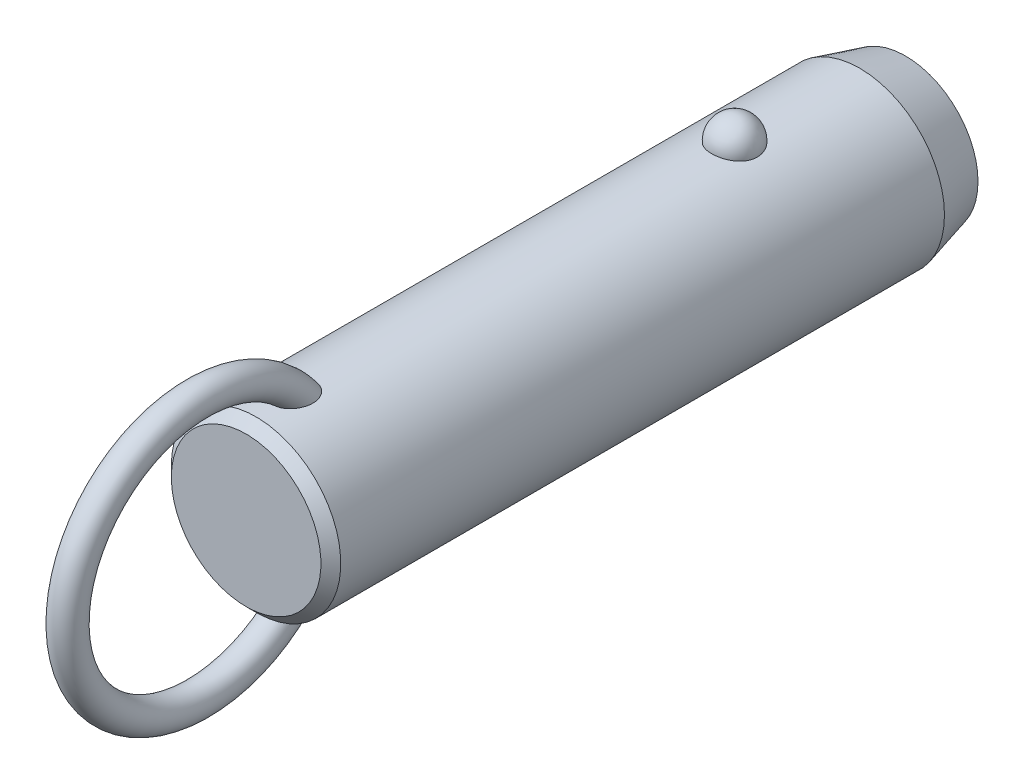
ISO-10303-21;
HEADER;
FILE_DESCRIPTION(('STEP AP214'),'2;1');
FILE_NAME('part.step','',(''),(''),'','','');
FILE_SCHEMA(('AUTOMOTIVE_DESIGN { 1 0 10303 214 1 1 1 1 }'));
ENDSEC;
DATA;
#1=APPLICATION_CONTEXT('core data for automotive mechanical design processes');
#2=APPLICATION_PROTOCOL_DEFINITION('international standard','automotive_design',2000,#1);
#3=PRODUCT_CONTEXT('',#1,'mechanical');
#4=PRODUCT('Part','Part','',(#3));
#5=PRODUCT_RELATED_PRODUCT_CATEGORY('part','',(#4));
#6=PRODUCT_DEFINITION_FORMATION('','',#4);
#7=PRODUCT_DEFINITION_CONTEXT('part definition',#1,'design');
#8=PRODUCT_DEFINITION('design','',#6,#7);
#9=PRODUCT_DEFINITION_SHAPE('','',#8);
#10=(LENGTH_UNIT() NAMED_UNIT(*) SI_UNIT(.MILLI.,.METRE.));
#11=(NAMED_UNIT(*) PLANE_ANGLE_UNIT() SI_UNIT($,.RADIAN.));
#12=(NAMED_UNIT(*) SI_UNIT($,.STERADIAN.) SOLID_ANGLE_UNIT());
#13=UNCERTAINTY_MEASURE_WITH_UNIT(LENGTH_MEASURE(1.E-05),#10,'distance_accuracy_value','');
#14=(GEOMETRIC_REPRESENTATION_CONTEXT(3) GLOBAL_UNCERTAINTY_ASSIGNED_CONTEXT((#13)) GLOBAL_UNIT_ASSIGNED_CONTEXT((#10,
#11,#12)) REPRESENTATION_CONTEXT('',''));
#15=CARTESIAN_POINT('',(0.,0.,0.));
#16=DIRECTION('',(0.,0.,1.));
#17=DIRECTION('',(1.,0.,0.));
#18=AXIS2_PLACEMENT_3D('',#15,#16,#17);
#19=CARTESIAN_POINT('',(0.,0.,48.3));
#20=DIRECTION('',(0.,0.,-1.));
#21=DIRECTION('',(-1.,0.,0.));
#22=AXIS2_PLACEMENT_3D('',#19,#20,#21);
#23=CYLINDRICAL_SURFACE('',#22,11.1);
#24=CARTESIAN_POINT('',(2.9724815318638,10.6945945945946,-3.));
#25=CARTESIAN_POINT('',(2.97247830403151,10.6945972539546,-2.83225059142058));
#26=CARTESIAN_POINT('',(2.95876598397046,10.6984356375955,-2.6644597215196));
#27=CARTESIAN_POINT('',(2.90424529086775,10.7133624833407,-2.33362381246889));
#28=CARTESIAN_POINT('',(2.8634252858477,10.7244540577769,-2.1705808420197));
#29=CARTESIAN_POINT('',(2.75573657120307,10.7526272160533,-1.85396767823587));
#30=CARTESIAN_POINT('',(2.68887937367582,10.7697061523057,-1.70039333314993));
#31=CARTESIAN_POINT('',(2.53079696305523,10.8079438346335,-1.40691598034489));
#32=CARTESIAN_POINT('',(2.43957264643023,10.8291024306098,-1.2670124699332));
#33=CARTESIAN_POINT('',(2.23458150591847,10.8732541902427,-1.00409565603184));
#34=CARTESIAN_POINT('',(2.12071295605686,10.8962553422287,-0.881162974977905));
#35=CARTESIAN_POINT('',(1.87365402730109,10.9414421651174,-0.656352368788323));
#36=CARTESIAN_POINT('',(1.74046358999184,10.9636278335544,-0.554474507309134));
#37=CARTESIAN_POINT('',(1.45872188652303,11.0046495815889,-0.374872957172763));
#38=CARTESIAN_POINT('',(1.31021276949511,11.0234944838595,-0.297085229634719));
#39=CARTESIAN_POINT('',(1.00170030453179,11.0557957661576,-0.16752977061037));
#40=CARTESIAN_POINT('',(0.841698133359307,11.0692526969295,-0.115759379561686));
#41=CARTESIAN_POINT('',(0.517607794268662,11.0890932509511,-0.040392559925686));
#42=CARTESIAN_POINT('',(0.353633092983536,11.0955916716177,-0.0163383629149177));
#43=CARTESIAN_POINT('',(0.0238420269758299,11.1011989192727,0.00445177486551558));
#44=CARTESIAN_POINT('',(-0.141974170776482,11.1003084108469,0.00119017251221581));
#45=CARTESIAN_POINT('',(-0.468405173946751,11.0912990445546,-0.0323233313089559));
#46=CARTESIAN_POINT('',(-0.629059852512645,11.0832767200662,-0.0622147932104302));
#47=CARTESIAN_POINT('',(-0.942937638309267,11.0609962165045,-0.147645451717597));
#48=CARTESIAN_POINT('',(-1.09616062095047,11.0467379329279,-0.203185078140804));
#49=CARTESIAN_POINT('',(-1.39181061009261,11.0134071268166,-0.3387529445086));
#50=CARTESIAN_POINT('',(-1.53417383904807,10.9943086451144,-0.418913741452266));
#51=CARTESIAN_POINT('',(-1.80342160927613,10.9533667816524,-0.601448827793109));
#52=CARTESIAN_POINT('',(-1.9303046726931,10.9315231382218,-0.703825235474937));
#53=CARTESIAN_POINT('',(-2.16747598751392,10.887005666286,-0.930091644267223));
#54=CARTESIAN_POINT('',(-2.27742774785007,10.8643239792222,-1.05433291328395));
#55=CARTESIAN_POINT('',(-2.47517316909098,10.8209886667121,-1.31966633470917));
#56=CARTESIAN_POINT('',(-2.56296538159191,10.8003351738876,-1.46075958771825));
#57=CARTESIAN_POINT('',(-2.71500300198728,10.7631304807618,-1.75753646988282));
#58=CARTESIAN_POINT('',(-2.77898901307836,10.7466250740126,-1.9133588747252));
#59=CARTESIAN_POINT('',(-2.88046189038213,10.7198747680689,-2.2339152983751));
#60=CARTESIAN_POINT('',(-2.91794947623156,10.709629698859,-2.39864907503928));
#61=CARTESIAN_POINT('',(-2.96537819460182,10.6965949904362,-2.73165170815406));
#62=CARTESIAN_POINT('',(-2.97542891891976,10.693775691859,-2.89990378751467));
#63=CARTESIAN_POINT('',(-2.96804271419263,10.6958279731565,-3.235752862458));
#64=CARTESIAN_POINT('',(-2.95060646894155,10.7006993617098,-3.40334987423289));
#65=CARTESIAN_POINT('',(-2.88883358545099,10.71753912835,-3.73233906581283));
#66=CARTESIAN_POINT('',(-2.84462026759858,10.7294749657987,-3.89375610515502));
#67=CARTESIAN_POINT('',(-2.73050447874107,10.7590797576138,-4.20667949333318));
#68=CARTESIAN_POINT('',(-2.66060103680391,10.7767489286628,-4.35818546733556));
#69=CARTESIAN_POINT('',(-2.49642559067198,10.8159599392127,-4.6478542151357));
#70=CARTESIAN_POINT('',(-2.40203047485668,10.8375211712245,-4.78594458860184));
#71=CARTESIAN_POINT('',(-2.19143488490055,10.8820570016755,-5.0441038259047));
#72=CARTESIAN_POINT('',(-2.07523364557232,10.9050316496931,-5.16417205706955));
#73=CARTESIAN_POINT('',(-1.82361254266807,10.9499219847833,-5.38334833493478));
#74=CARTESIAN_POINT('',(-1.68812945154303,10.9718338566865,-5.48238464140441));
#75=CARTESIAN_POINT('',(-1.40191298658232,11.0120611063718,-5.65618873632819));
#76=CARTESIAN_POINT('',(-1.25118062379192,11.0303767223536,-5.73095813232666));
#77=CARTESIAN_POINT('',(-0.940570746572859,11.0611653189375,-5.85334725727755));
#78=CARTESIAN_POINT('',(-0.780821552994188,11.0737044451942,-5.90127578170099));
#79=CARTESIAN_POINT('',(-0.455204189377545,11.0918598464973,-5.96992976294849));
#80=CARTESIAN_POINT('',(-0.289336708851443,11.0974768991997,-5.99065827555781));
#81=CARTESIAN_POINT('',(0.0406846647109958,11.1011307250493,-6.00418773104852));
#82=CARTESIAN_POINT('',(0.204817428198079,11.099299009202,-5.99747318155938));
#83=CARTESIAN_POINT('',(0.529553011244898,11.088551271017,-5.9574031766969));
#84=CARTESIAN_POINT('',(0.690155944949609,11.0796354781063,-5.92404858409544));
#85=CARTESIAN_POINT('',(1.0027760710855,11.0557204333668,-5.83180084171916));
#86=CARTESIAN_POINT('',(1.15482001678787,11.0407414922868,-5.77299291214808));
#87=CARTESIAN_POINT('',(1.44678373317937,11.0062913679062,-5.63147366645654));
#88=CARTESIAN_POINT('',(1.58670279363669,10.9868199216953,-5.54876095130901));
#89=CARTESIAN_POINT('',(1.8527023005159,10.9451315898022,-5.36027644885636));
#90=CARTESIAN_POINT('',(1.97855158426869,10.9228788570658,-5.25418644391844));
#91=CARTESIAN_POINT('',(2.21080872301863,10.8782509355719,-5.02251354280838));
#92=CARTESIAN_POINT('',(2.31721312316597,10.8558757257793,-4.89692718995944));
#93=CARTESIAN_POINT('',(2.5094551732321,10.8130715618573,-4.62745408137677));
#94=CARTESIAN_POINT('',(2.59493284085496,10.7926798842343,-4.48330448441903));
#95=CARTESIAN_POINT('',(2.740862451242,10.7565495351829,-4.18236358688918));
#96=CARTESIAN_POINT('',(2.80132490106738,10.7408089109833,-4.02557762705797));
#97=CARTESIAN_POINT('',(2.88959070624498,10.7173718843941,-3.72475308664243));
#98=CARTESIAN_POINT('',(2.92062102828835,10.7088950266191,-3.58171216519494));
#99=CARTESIAN_POINT('',(2.96206765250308,10.6975052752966,-3.29245795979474));
#100=CARTESIAN_POINT('',(2.97248434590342,10.6945922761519,-3.14624473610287));
#101=CARTESIAN_POINT('',(2.9724815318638,10.6945945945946,-3.));
#102=B_SPLINE_CURVE_WITH_KNOTS('',3,(#24,#25,#26,#27,#28,#29,#30,#31,#32,#33,#34,#35,#36,#37,
#38,#39,#40,#41,#42,#43,#44,#45,#46,#47,#48,#49,#50,#51,#52,#53,#54,#55,#56,#57,#58,#59,#60,#61,
#62,#63,#64,#65,#66,#67,#68,#69,#70,#71,#72,#73,#74,#75,#76,#77,#78,#79,#80,#81,#82,#83,#84,#85,
#86,#87,#88,#89,#90,#91,#92,#93,#94,#95,#96,#97,#98,#99,#100,#101),.UNSPECIFIED.,.T.,.F.,(4,2,2,
2,2,2,2,2,2,2,2,2,2,2,2,2,2,2,2,2,2,2,2,2,2,2,2,2,2,2,2,2,2,2,2,2,2,2,4),(0.,0.502722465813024,
1.00566079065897,1.5083769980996,2.01107471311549,2.51608392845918,3.02109467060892,
3.52475118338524,4.02835620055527,4.523518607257,5.0186364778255,5.50715297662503,
5.9956776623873,6.48688002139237,6.97812923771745,7.47814366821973,7.9781907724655,
8.48353712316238,8.9888697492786,9.49218093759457,9.99547960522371,10.4964777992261,
10.997494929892,11.5010810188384,12.0046847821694,12.5099796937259,13.0152411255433,
13.5145635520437,14.0138298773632,14.5043200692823,14.9947943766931,15.4836390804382,
15.9725123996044,16.4685040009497,16.9645836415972,17.4686765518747,17.972557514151,
18.410841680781,18.849117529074),.UNSPECIFIED.);
#103=CARTESIAN_POINT('',(2.9724815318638,10.6945945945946,-3.));
#104=VERTEX_POINT('',#103);
#105=EDGE_CURVE('E41',#104,#104,#102,.T.);
#106=ORIENTED_EDGE('',*,*,#105,.T.);
#107=EDGE_LOOP('',(#106));
#108=FACE_BOUND('',#107,.T.);
#109=CARTESIAN_POINT('',(0.,0.,59.7000000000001));
#110=DIRECTION('',(0.,0.,1.));
#111=DIRECTION('',(1.,0.,0.));
#112=AXIS2_PLACEMENT_3D('',#109,#110,#111);
#113=CIRCLE('',#112,11.1);
#114=CARTESIAN_POINT('',(-11.1,0.,59.7000000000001));
#115=VERTEX_POINT('',#114);
#116=EDGE_CURVE('E10',#115,#115,#113,.F.);
#117=ORIENTED_EDGE('',*,*,#116,.T.);
#118=EDGE_LOOP('',(#117));
#119=FACE_BOUND('',#118,.T.);
#120=CARTESIAN_POINT('',(-0.56452033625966,-11.0856356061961,51.957815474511));
#121=CARTESIAN_POINT('',(-0.66720283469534,-11.0804062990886,51.9912839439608));
#122=CARTESIAN_POINT('',(-0.766875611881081,-11.0738877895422,52.0338357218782));
#123=CARTESIAN_POINT('',(-0.957284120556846,-11.0590576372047,52.1354190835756));
#124=CARTESIAN_POINT('',(-1.04801616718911,-11.0507452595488,52.1944574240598));
#125=CARTESIAN_POINT('',(-1.21800952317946,-11.0333016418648,52.3265293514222));
#126=CARTESIAN_POINT('',(-1.29730805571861,-11.0241732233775,52.3995156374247));
#127=CARTESIAN_POINT('',(-1.44337665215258,-11.0060026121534,52.5570374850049));
#128=CARTESIAN_POINT('',(-1.51014622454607,-10.9969604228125,52.6415734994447));
#129=CARTESIAN_POINT('',(-1.63454620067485,-10.9791841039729,52.8255213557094));
#130=CARTESIAN_POINT('',(-1.69127003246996,-10.9705107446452,52.9255493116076));
#131=CARTESIAN_POINT('',(-1.78980785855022,-10.9548648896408,53.1327902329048));
#132=CARTESIAN_POINT('',(-1.83161214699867,-10.9478935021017,53.2400078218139));
#133=CARTESIAN_POINT('',(-1.91557028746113,-10.9335803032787,53.5054080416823));
#134=CARTESIAN_POINT('',(-1.95040620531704,-10.9273269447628,53.6659806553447));
#135=CARTESIAN_POINT('',(-1.99388326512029,-10.9194709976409,53.9906977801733));
#136=CARTESIAN_POINT('',(-2.00248051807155,-10.9178762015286,54.1548478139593));
#137=CARTESIAN_POINT('',(-1.99551615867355,-10.9191578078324,54.5246504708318));
#138=CARTESIAN_POINT('',(-1.9732206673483,-10.9232807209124,54.7301911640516));
#139=CARTESIAN_POINT('',(-1.9152976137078,-10.9335244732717,55.033595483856));
#140=CARTESIAN_POINT('',(-1.89184575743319,-10.9376266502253,55.1340883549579));
#141=CARTESIAN_POINT('',(-1.83700674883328,-10.9469720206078,55.332855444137));
#142=CARTESIAN_POINT('',(-1.80562070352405,-10.9522150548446,55.4311299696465));
#143=CARTESIAN_POINT('',(-1.73463055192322,-10.9636837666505,55.6259148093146));
#144=CARTESIAN_POINT('',(-1.69493416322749,-10.9699202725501,55.7223907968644));
#145=CARTESIAN_POINT('',(-1.60745141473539,-10.9830806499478,55.9116262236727));
#146=CARTESIAN_POINT('',(-1.55966150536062,-10.9900048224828,56.0043840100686));
#147=CARTESIAN_POINT('',(-1.45591812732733,-11.0042280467,56.1846907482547));
#148=CARTESIAN_POINT('',(-1.40000013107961,-11.0115253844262,56.2722601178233));
#149=CARTESIAN_POINT('',(-1.2793747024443,-11.0261911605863,56.441029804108));
#150=CARTESIAN_POINT('',(-1.21467835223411,-11.0335594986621,56.5222379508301));
#151=CARTESIAN_POINT('',(-1.08218150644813,-11.0473027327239,56.6690010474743));
#152=CARTESIAN_POINT('',(-1.0152263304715,-11.0537063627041,56.7353092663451));
#153=CARTESIAN_POINT('',(-0.872952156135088,-11.065850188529,56.8583780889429));
#154=CARTESIAN_POINT('',(-0.797642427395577,-11.0715911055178,56.9151491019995));
#155=CARTESIAN_POINT('',(-0.651396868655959,-11.081071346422,57.0075155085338));
#156=CARTESIAN_POINT('',(-0.581712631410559,-11.0849841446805,57.0450491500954));
#157=CARTESIAN_POINT('',(-0.437066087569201,-11.0916271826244,57.1082594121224));
#158=CARTESIAN_POINT('',(-0.362109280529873,-11.0943586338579,57.1339481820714));
#159=CARTESIAN_POINT('',(-0.207828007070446,-11.0983242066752,57.171117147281));
#160=CARTESIAN_POINT('',(-0.128467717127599,-11.0995432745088,57.1824545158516));
#161=CARTESIAN_POINT('',(0.0309101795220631,-11.1002423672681,57.1889658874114));
#162=CARTESIAN_POINT('',(0.110927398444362,-11.0997233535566,57.1841488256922));
#163=CARTESIAN_POINT('',(0.256406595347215,-11.097240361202,57.1609599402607));
#164=CARTESIAN_POINT('',(0.322235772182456,-11.0955074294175,57.1447543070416));
#165=CARTESIAN_POINT('',(0.450635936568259,-11.0910350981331,57.1026008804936));
#166=CARTESIAN_POINT('',(0.513205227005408,-11.0882951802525,57.0766480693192));
#167=CARTESIAN_POINT('',(0.662626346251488,-11.0805620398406,57.0026073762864));
#168=CARTESIAN_POINT('',(0.747127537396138,-11.0751144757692,56.9498452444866));
#169=CARTESIAN_POINT('',(0.906756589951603,-11.0631932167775,56.8317206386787));
#170=CARTESIAN_POINT('',(0.981859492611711,-11.0567168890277,56.7663257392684));
#171=CARTESIAN_POINT('',(1.1071220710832,-11.0447856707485,56.6422633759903));
#172=CARTESIAN_POINT('',(1.15909566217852,-11.0394280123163,56.5853831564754));
#173=CARTESIAN_POINT('',(1.25791923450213,-11.0286040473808,56.4673271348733));
#174=CARTESIAN_POINT('',(1.30476642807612,-11.0231376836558,56.4061490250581));
#175=CARTESIAN_POINT('',(1.43818612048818,-11.0068027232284,56.217305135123));
#176=CARTESIAN_POINT('',(1.51751767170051,-10.9960104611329,56.0844531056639));
#177=CARTESIAN_POINT('',(1.63597546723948,-10.9788847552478,55.8531371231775));
#178=CARTESIAN_POINT('',(1.67988876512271,-10.9722190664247,55.7570530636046));
#179=CARTESIAN_POINT('',(1.75953241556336,-10.9597298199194,55.5614311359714));
#180=CARTESIAN_POINT('',(1.79525967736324,-10.9539065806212,55.4618919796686));
#181=CARTESIAN_POINT('',(1.85844731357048,-10.9433632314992,55.2602111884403));
#182=CARTESIAN_POINT('',(1.88591073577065,-10.9386427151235,55.1580705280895));
#183=CARTESIAN_POINT('',(1.93234324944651,-10.9305350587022,54.951819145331));
#184=CARTESIAN_POINT('',(1.95131065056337,-10.9271481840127,54.8477080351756));
#185=CARTESIAN_POINT('',(1.99040203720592,-10.9201183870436,54.5654588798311));
#186=CARTESIAN_POINT('',(2.00221217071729,-10.9179256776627,54.3860370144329));
#187=CARTESIAN_POINT('',(1.99711676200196,-10.9188636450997,54.0277133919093));
#188=CARTESIAN_POINT('',(1.98026150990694,-10.9219849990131,53.8488112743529));
#189=CARTESIAN_POINT('',(1.92151657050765,-10.9324473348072,53.5364514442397));
#190=CARTESIAN_POINT('',(1.88605081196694,-10.9386915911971,53.4017594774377));
#191=CARTESIAN_POINT('',(1.79393020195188,-10.9541780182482,53.1399669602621));
#192=CARTESIAN_POINT('',(1.73729868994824,-10.9634168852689,53.0128582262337));
#193=CARTESIAN_POINT('',(1.61237037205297,-10.9824218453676,52.7894184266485));
#194=CARTESIAN_POINT('',(1.54715374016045,-10.9918945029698,52.6913455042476));
#195=CARTESIAN_POINT('',(1.40127026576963,-11.0114415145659,52.5074341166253));
#196=CARTESIAN_POINT('',(1.3206074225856,-11.0215157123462,52.4215924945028));
#197=CARTESIAN_POINT('',(1.1447478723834,-11.041168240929,52.2651630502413));
#198=CARTESIAN_POINT('',(1.0494780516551,-11.0507437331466,52.1946565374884));
#199=CARTESIAN_POINT('',(0.847278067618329,-11.0680789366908,52.072640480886));
#200=CARTESIAN_POINT('',(0.740351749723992,-11.0758392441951,52.0211246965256));
#201=CARTESIAN_POINT('',(0.52928931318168,-11.0878275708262,51.9434852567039));
#202=CARTESIAN_POINT('',(0.425895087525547,-11.0923259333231,51.915377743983));
#203=CARTESIAN_POINT('',(0.215723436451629,-11.0984001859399,51.8777038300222));
#204=CARTESIAN_POINT('',(0.108947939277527,-11.0999777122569,51.8681270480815));
#205=CARTESIAN_POINT('',(-0.0938962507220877,-11.1000196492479,51.8678773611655));
#206=CARTESIAN_POINT('',(-0.189967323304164,-11.0987797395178,51.8754089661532));
#207=CARTESIAN_POINT('',(-0.3796579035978,-11.0939111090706,51.9055079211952));
#208=CARTESIAN_POINT('',(-0.473277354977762,-11.0902823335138,51.9280756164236));
#209=CARTESIAN_POINT('',(-0.56452033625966,-11.0856356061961,51.957815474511));
#210=B_SPLINE_CURVE_WITH_KNOTS('',3,(#120,#121,#122,#123,#124,#125,#126,#127,#128,#129,#130,
#131,#132,#133,#134,#135,#136,#137,#138,#139,#140,#141,#142,#143,#144,#145,#146,#147,#148,#149,
#150,#151,#152,#153,#154,#155,#156,#157,#158,#159,#160,#161,#162,#163,#164,#165,#166,#167,#168,
#169,#170,#171,#172,#173,#174,#175,#176,#177,#178,#179,#180,#181,#182,#183,#184,#185,#186,#187,
#188,#189,#190,#191,#192,#193,#194,#195,#196,#197,#198,#199,#200,#201,#202,#203,#204,#205,#206,
#207,#208,#209),.UNSPECIFIED.,.T.,.F.,(4,2,2,2,2,2,2,2,2,2,2,2,2,2,2,2,2,2,2,2,2,2,2,2,2,2,2,2,
2,2,2,2,2,2,2,2,2,2,2,2,2,2,2,2,4),(0.,0.323999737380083,0.648132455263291,0.971184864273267,
1.29424994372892,1.6388623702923,1.98369857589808,2.4742605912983,2.96564271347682,
3.58257396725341,3.89215258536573,4.20168803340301,4.51486273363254,4.82817514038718,
5.14015911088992,5.45175282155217,5.734428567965,6.01679375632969,6.25364580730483,
6.49025437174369,6.72919963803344,6.9680127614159,7.17061258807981,7.37331685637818,
7.67094989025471,7.96935728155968,8.20075067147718,8.4322692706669,8.8958162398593,
9.21306533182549,9.53043400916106,9.84768549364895,10.1650000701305,10.70229304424,
11.2386443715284,11.6553390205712,12.0715755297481,12.4245637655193,12.7774607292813,
13.1321855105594,13.4867936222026,13.8068771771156,14.1267813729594,14.4146787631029,
14.7025827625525),.UNSPECIFIED.);
#211=CARTESIAN_POINT('',(-0.56452033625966,-11.0856356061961,51.957815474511));
#212=VERTEX_POINT('',#211);
#213=EDGE_CURVE('E59',#212,#212,#210,.T.);
#214=ORIENTED_EDGE('',*,*,#213,.T.);
#215=EDGE_LOOP('',(#214));
#216=FACE_BOUND('',#215,.T.);
#217=CARTESIAN_POINT('',(-0.56452033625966,11.0856356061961,51.957815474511));
#218=CARTESIAN_POINT('',(-0.468542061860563,11.0905203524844,51.9265456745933));
#219=CARTESIAN_POINT('',(-0.369793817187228,11.0942886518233,51.9031576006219));
#220=CARTESIAN_POINT('',(-0.16955579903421,11.0991586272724,51.8730858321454));
#221=CARTESIAN_POINT('',(-0.0680604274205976,11.1002543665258,51.8664393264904));
#222=CARTESIAN_POINT('',(0.134549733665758,11.099646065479,51.8701579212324));
#223=CARTESIAN_POINT('',(0.235664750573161,11.0979441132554,51.8805103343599));
#224=CARTESIAN_POINT('',(0.434632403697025,11.0919342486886,51.9178318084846));
#225=CARTESIAN_POINT('',(0.532486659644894,11.0876276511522,51.9447924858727));
#226=CARTESIAN_POINT('',(0.722445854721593,11.0768742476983,52.0144096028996));
#227=CARTESIAN_POINT('',(0.814543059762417,11.0704246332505,52.0570866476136));
#228=CARTESIAN_POINT('',(0.990565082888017,11.0560659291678,52.1566487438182));
#229=CARTESIAN_POINT('',(1.07448844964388,11.048156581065,52.2135363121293));
#230=CARTESIAN_POINT('',(1.23562672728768,11.0313221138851,52.3422106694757));
#231=CARTESIAN_POINT('',(1.31242684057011,11.0223686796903,52.4145117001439));
#232=CARTESIAN_POINT('',(1.45398030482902,11.0045918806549,52.5700425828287));
#233=CARTESIAN_POINT('',(1.51873073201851,10.9957685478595,52.6532750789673));
#234=CARTESIAN_POINT('',(1.64107232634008,10.9782087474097,52.8363842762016));
#235=CARTESIAN_POINT('',(1.6974317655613,10.9695572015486,52.9370893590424));
#236=CARTESIAN_POINT('',(1.79515063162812,10.9539887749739,53.1456264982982));
#237=CARTESIAN_POINT('',(1.83649966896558,10.9470730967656,53.2534634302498));
#238=CARTESIAN_POINT('',(1.91931148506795,10.9329211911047,53.5203995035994));
#239=CARTESIAN_POINT('',(1.95340104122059,10.9267904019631,53.6818612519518));
#240=CARTESIAN_POINT('',(1.99526195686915,10.9192174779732,54.0082163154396));
#241=CARTESIAN_POINT('',(2.00298989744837,10.9177830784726,54.1731148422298));
#242=CARTESIAN_POINT('',(1.99396251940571,10.9194420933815,54.5441006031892));
#243=CARTESIAN_POINT('',(1.97050829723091,10.923774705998,54.7500387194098));
#244=CARTESIAN_POINT('',(1.91079643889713,10.9343131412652,55.0539019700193));
#245=CARTESIAN_POINT('',(1.8867370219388,10.9385106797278,55.1545296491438));
#246=CARTESIAN_POINT('',(1.83065508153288,10.9480376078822,55.3535107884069));
#247=CARTESIAN_POINT('',(1.79863369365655,10.9533668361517,55.451864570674));
#248=CARTESIAN_POINT('',(1.72633365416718,10.9649954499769,55.6467203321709));
#249=CARTESIAN_POINT('',(1.68596409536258,10.9713053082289,55.7431879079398));
#250=CARTESIAN_POINT('',(1.59707998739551,10.9845964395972,55.9323233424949));
#251=CARTESIAN_POINT('',(1.54856169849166,10.9915780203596,56.0249894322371));
#252=CARTESIAN_POINT('',(1.4433016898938,11.0058935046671,56.2049752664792));
#253=CARTESIAN_POINT('',(1.38659749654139,11.0132257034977,56.292316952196));
#254=CARTESIAN_POINT('',(1.26431158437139,11.0279330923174,56.4604563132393));
#255=CARTESIAN_POINT('',(1.198741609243,11.0353082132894,56.5412624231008));
#256=CARTESIAN_POINT('',(1.06542088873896,11.048931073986,56.6859856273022));
#257=CARTESIAN_POINT('',(0.998640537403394,11.0552153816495,56.750784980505));
#258=CARTESIAN_POINT('',(0.856896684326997,11.0671032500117,56.8708462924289));
#259=CARTESIAN_POINT('',(0.781942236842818,11.0727075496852,56.9261186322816));
#260=CARTESIAN_POINT('',(0.636276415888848,11.081949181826,57.0159721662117));
#261=CARTESIAN_POINT('',(0.566755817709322,11.0857572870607,57.0524410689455));
#262=CARTESIAN_POINT('',(0.422602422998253,11.0921860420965,57.1135333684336));
#263=CARTESIAN_POINT('',(0.347974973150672,11.0948079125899,57.1381689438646));
#264=CARTESIAN_POINT('',(0.194593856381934,11.0985608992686,57.1733233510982));
#265=CARTESIAN_POINT('',(0.11580793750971,11.0996777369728,57.1837069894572));
#266=CARTESIAN_POINT('',(-0.042249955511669,11.1002003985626,57.1885747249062));
#267=CARTESIAN_POINT('',(-0.121521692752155,11.09960699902,57.183066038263));
#268=CARTESIAN_POINT('',(-0.266046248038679,11.0970123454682,57.1588271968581));
#269=CARTESIAN_POINT('',(-0.331661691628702,11.0952283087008,57.1421356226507));
#270=CARTESIAN_POINT('',(-0.459588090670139,11.0906663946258,57.0991117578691));
#271=CARTESIAN_POINT('',(-0.521897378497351,11.0878880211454,57.072774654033));
#272=CARTESIAN_POINT('',(-0.671446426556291,11.0800342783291,56.9975130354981));
#273=CARTESIAN_POINT('',(-0.756250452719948,11.0744969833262,56.9438182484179));
#274=CARTESIAN_POINT('',(-0.916349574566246,11.0624045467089,56.8238029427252));
#275=CARTESIAN_POINT('',(-0.991618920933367,11.0558467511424,56.7574493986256));
#276=CARTESIAN_POINT('',(-1.11713140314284,11.0437783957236,56.6316335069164));
#277=CARTESIAN_POINT('',(-1.16920539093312,11.0383619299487,56.5739524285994));
#278=CARTESIAN_POINT('',(-1.26817476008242,11.02743010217,56.4542809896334));
#279=CARTESIAN_POINT('',(-1.315067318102,11.0219146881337,56.3922883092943));
#280=CARTESIAN_POINT('',(-1.40399813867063,11.0109399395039,56.2647843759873));
#281=CARTESIAN_POINT('',(-1.4460286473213,11.0054807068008,56.1992677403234));
#282=CARTESIAN_POINT('',(-1.52538779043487,10.9947621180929,56.0654223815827));
#283=CARTESIAN_POINT('',(-1.56271516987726,10.9895028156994,55.9970929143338));
#284=CARTESIAN_POINT('',(-1.64537943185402,10.9774790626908,55.8332101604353));
#285=CARTESIAN_POINT('',(-1.68879497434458,10.9708503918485,55.7366735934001));
#286=CARTESIAN_POINT('',(-1.76740738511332,10.9584602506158,55.5402369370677));
#287=CARTESIAN_POINT('',(-1.80260120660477,10.95269910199,55.4403356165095));
#288=CARTESIAN_POINT('',(-1.86468657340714,10.9423003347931,55.2379663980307));
#289=CARTESIAN_POINT('',(-1.8915816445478,10.9376622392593,55.1354996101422));
#290=CARTESIAN_POINT('',(-1.93682458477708,10.9297405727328,54.9286429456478));
#291=CARTESIAN_POINT('',(-1.95517082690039,10.9264572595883,54.8242527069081));
#292=CARTESIAN_POINT('',(-1.99232562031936,10.9197647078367,54.5426287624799));
#293=CARTESIAN_POINT('',(-2.00294603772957,10.9177914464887,54.3641857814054));
#294=CARTESIAN_POINT('',(-1.99566675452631,10.9191290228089,54.0079962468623));
#295=CARTESIAN_POINT('',(-1.97781651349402,10.9224306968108,53.8302490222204));
#296=CARTESIAN_POINT('',(-1.91747214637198,10.9331592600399,53.5197921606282));
#297=CARTESIAN_POINT('',(-1.88131022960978,10.9395108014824,53.385825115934));
#298=CARTESIAN_POINT('',(-1.78790380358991,10.9551659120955,53.1255975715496));
#299=CARTESIAN_POINT('',(-1.73068309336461,10.9644661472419,52.9993285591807));
#300=CARTESIAN_POINT('',(-1.60475573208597,10.9835398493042,52.7774156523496));
#301=CARTESIAN_POINT('',(-1.53908879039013,10.9930297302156,52.6800265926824));
#302=CARTESIAN_POINT('',(-1.39238608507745,11.0125708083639,52.4975250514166));
#303=CARTESIAN_POINT('',(-1.31135150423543,11.0226219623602,52.4124116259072));
#304=CARTESIAN_POINT('',(-1.14382035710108,11.0411991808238,52.2652994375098));
#305=CARTESIAN_POINT('',(-1.05858500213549,11.0497792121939,52.2018693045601));
#306=CARTESIAN_POINT('',(-0.878723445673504,11.0655285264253,52.0902505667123));
#307=CARTESIAN_POINT('',(-0.784123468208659,11.0727015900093,52.0420208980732));
#308=CARTESIAN_POINT('',(-0.646163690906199,11.0812501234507,51.986023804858));
#309=CARTESIAN_POINT('',(-0.605595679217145,11.0835451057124,51.9711978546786));
#310=CARTESIAN_POINT('',(-0.56452033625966,11.0856356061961,51.957815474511));
#311=B_SPLINE_CURVE_WITH_KNOTS('',3,(#217,#218,#219,#220,#221,#222,#223,#224,#225,#226,#227,
#228,#229,#230,#231,#232,#233,#234,#235,#236,#237,#238,#239,#240,#241,#242,#243,#244,#245,#246,
#247,#248,#249,#250,#251,#252,#253,#254,#255,#256,#257,#258,#259,#260,#261,#262,#263,#264,#265,
#266,#267,#268,#269,#270,#271,#272,#273,#274,#275,#276,#277,#278,#279,#280,#281,#282,#283,#284,
#285,#286,#287,#288,#289,#290,#291,#292,#293,#294,#295,#296,#297,#298,#299,#300,#301,#302,#303,
#304,#305,#306,#307,#308,#309,#310),.UNSPECIFIED.,.T.,.F.,(4,2,2,2,2,2,2,2,2,2,2,2,2,2,2,2,2,2,
2,2,2,2,2,2,2,2,2,2,2,2,2,2,2,2,2,2,2,2,2,2,2,2,2,2,2,2,4),(0.,0.303061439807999,
0.606795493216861,0.910302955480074,1.21365733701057,1.51741085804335,1.82121821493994,
2.13745205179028,2.45376252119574,2.799586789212,3.14564996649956,3.63832391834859,
4.13180893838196,4.75031912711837,5.06071926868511,5.37107516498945,5.68500772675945,
5.99908475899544,6.3117651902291,6.62403542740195,6.90315673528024,7.18197194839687,
7.41687778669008,7.6515413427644,7.8884158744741,8.12518286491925,8.32752842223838,
8.52997509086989,8.82986421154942,9.13054668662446,9.36393502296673,9.59744991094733,
9.83133221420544,10.0652767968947,10.383032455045,10.7009056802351,11.0186436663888,
11.3364420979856,11.8705925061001,12.4038159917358,12.8189662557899,13.2336487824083,
13.5857049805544,13.9377340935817,14.2561354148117,14.5736690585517,14.7033687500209),.UNSPECIFIED.);
#312=CARTESIAN_POINT('',(-0.56452033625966,11.0856356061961,51.957815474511));
#313=VERTEX_POINT('',#312);
#314=EDGE_CURVE('E67',#313,#313,#311,.T.);
#315=ORIENTED_EDGE('',*,*,#314,.T.);
#316=EDGE_LOOP('',(#315));
#317=FACE_BOUND('',#316,.T.);
#318=CARTESIAN_POINT('',(0.,0.,-19.4));
#319=DIRECTION('',(0.,0.,-1.));
#320=DIRECTION('',(-1.,0.,0.));
#321=AXIS2_PLACEMENT_3D('',#318,#319,#320);
#322=CIRCLE('',#321,11.1);
#323=CARTESIAN_POINT('',(11.1,0.,-19.4));
#324=VERTEX_POINT('',#323);
#325=EDGE_CURVE('E56',#324,#324,#322,.F.);
#326=ORIENTED_EDGE('',*,*,#325,.T.);
#327=EDGE_LOOP('',(#326));
#328=FACE_BOUND('',#327,.T.);
#329=ADVANCED_FACE('F37',(#108,#119,#216,#317,#328),#23,.T.);
#330=CARTESIAN_POINT('',(0.,0.,-25.4));
#331=DIRECTION('',(0.,0.,-1.));
#332=DIRECTION('',(-1.,0.,0.));
#333=AXIS2_PLACEMENT_3D('',#330,#331,#332);
#334=PLANE('',#333);
#335=CARTESIAN_POINT('',(0.,0.,-25.4));
#336=DIRECTION('',(0.,0.,-1.));
#337=DIRECTION('',(-1.,0.,0.));
#338=AXIS2_PLACEMENT_3D('',#335,#336,#337);
#339=CIRCLE('',#338,9.49230484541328);
#340=CARTESIAN_POINT('',(9.49230484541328,0.,-25.4));
#341=VERTEX_POINT('',#340);
#342=EDGE_CURVE('E66',#341,#341,#339,.T.);
#343=ORIENTED_EDGE('',*,*,#342,.T.);
#344=EDGE_LOOP('',(#343));
#345=FACE_BOUND('',#344,.T.);
#346=ADVANCED_FACE('F85',(#345),#334,.T.);
#347=CARTESIAN_POINT('',(0.,0.,-25.4));
#348=DIRECTION('',(0.,0.,1.));
#349=DIRECTION('',(1.,0.,0.));
#350=AXIS2_PLACEMENT_3D('',#347,#348,#349);
#351=CONICAL_SURFACE('',#350,9.49230484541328,0.261799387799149);
#352=CARTESIAN_POINT('',(11.1,0.,-19.4));
#353=CARTESIAN_POINT('',(11.0832531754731,0.,-19.4625));
#354=CARTESIAN_POINT('',(11.0665063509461,0.,-19.525));
#355=CARTESIAN_POINT('',(11.0330127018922,0.,-19.65));
#356=CARTESIAN_POINT('',(11.0162658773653,0.,-19.7125));
#357=CARTESIAN_POINT('',(10.9827722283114,0.,-19.8375));
#358=CARTESIAN_POINT('',(10.9660254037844,0.,-19.9));
#359=CARTESIAN_POINT('',(10.9325317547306,0.,-20.025));
#360=CARTESIAN_POINT('',(10.9157849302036,0.,-20.0875));
#361=CARTESIAN_POINT('',(10.8822912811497,0.,-20.2125));
#362=CARTESIAN_POINT('',(10.8655444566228,0.,-20.275));
#363=CARTESIAN_POINT('',(10.8320508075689,0.,-20.4));
#364=CARTESIAN_POINT('',(10.8153039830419,0.,-20.4625));
#365=CARTESIAN_POINT('',(10.781810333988,0.,-20.5875));
#366=CARTESIAN_POINT('',(10.7650635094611,0.,-20.65));
#367=CARTESIAN_POINT('',(10.7315698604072,0.,-20.775));
#368=CARTESIAN_POINT('',(10.7148230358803,0.,-20.8375));
#369=CARTESIAN_POINT('',(10.6813293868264,0.,-20.9625));
#370=CARTESIAN_POINT('',(10.6645825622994,0.,-21.025));
#371=CARTESIAN_POINT('',(10.6310889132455,0.,-21.15));
#372=CARTESIAN_POINT('',(10.6143420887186,0.,-21.2125));
#373=CARTESIAN_POINT('',(10.5808484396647,0.,-21.3375));
#374=CARTESIAN_POINT('',(10.5641016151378,0.,-21.4));
#375=CARTESIAN_POINT('',(10.5306079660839,0.,-21.525));
#376=CARTESIAN_POINT('',(10.5138611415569,0.,-21.5875));
#377=CARTESIAN_POINT('',(10.480367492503,0.,-21.7125));
#378=CARTESIAN_POINT('',(10.4636206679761,0.,-21.775));
#379=CARTESIAN_POINT('',(10.4301270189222,0.,-21.9));
#380=CARTESIAN_POINT('',(10.4133801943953,0.,-21.9625));
#381=CARTESIAN_POINT('',(10.3798865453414,0.,-22.0875));
#382=CARTESIAN_POINT('',(10.3631397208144,0.,-22.15));
#383=CARTESIAN_POINT('',(10.3296460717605,0.,-22.275));
#384=CARTESIAN_POINT('',(10.3128992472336,0.,-22.3375));
#385=CARTESIAN_POINT('',(10.2794055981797,0.,-22.4625));
#386=CARTESIAN_POINT('',(10.2626587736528,0.,-22.525));
#387=CARTESIAN_POINT('',(10.2291651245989,0.,-22.65));
#388=CARTESIAN_POINT('',(10.2124183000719,0.,-22.7125));
#389=CARTESIAN_POINT('',(10.178924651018,0.,-22.8375));
#390=CARTESIAN_POINT('',(10.1621778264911,0.,-22.9));
#391=CARTESIAN_POINT('',(10.1286841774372,0.,-23.025));
#392=CARTESIAN_POINT('',(10.1119373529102,0.,-23.0875));
#393=CARTESIAN_POINT('',(10.0784437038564,0.,-23.2125));
#394=CARTESIAN_POINT('',(10.0616968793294,0.,-23.275));
#395=CARTESIAN_POINT('',(10.0282032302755,0.,-23.4));
#396=CARTESIAN_POINT('',(10.0114564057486,0.,-23.4625));
#397=CARTESIAN_POINT('',(9.97796275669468,0.,-23.5875));
#398=CARTESIAN_POINT('',(9.96121593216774,0.,-23.65));
#399=CARTESIAN_POINT('',(9.92772228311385,0.,-23.775));
#400=CARTESIAN_POINT('',(9.9109754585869,0.,-23.8375));
#401=CARTESIAN_POINT('',(9.87748180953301,0.,-23.9625));
#402=CARTESIAN_POINT('',(9.86073498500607,0.,-24.025));
#403=CARTESIAN_POINT('',(9.82724133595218,0.,-24.15));
#404=CARTESIAN_POINT('',(9.81049451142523,0.,-24.2125));
#405=CARTESIAN_POINT('',(9.77700086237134,0.,-24.3375));
#406=CARTESIAN_POINT('',(9.7602540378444,0.,-24.4));
#407=CARTESIAN_POINT('',(9.72676038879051,0.,-24.525));
#408=CARTESIAN_POINT('',(9.71001356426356,0.,-24.5875));
#409=CARTESIAN_POINT('',(9.67651991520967,0.,-24.7125));
#410=CARTESIAN_POINT('',(9.65977309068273,0.,-24.775));
#411=CARTESIAN_POINT('',(9.62627944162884,0.,-24.9));
#412=CARTESIAN_POINT('',(9.60953261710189,0.,-24.9625));
#413=CARTESIAN_POINT('',(9.576038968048,0.,-25.0875));
#414=CARTESIAN_POINT('',(9.55929214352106,0.,-25.15));
#415=CARTESIAN_POINT('',(9.52579849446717,0.,-25.275));
#416=CARTESIAN_POINT('',(9.50905166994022,0.,-25.3375));
#417=CARTESIAN_POINT('',(9.49230484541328,0.,-25.4));
#418=B_SPLINE_CURVE_WITH_KNOTS('',3,(#352,#353,#354,#355,#356,#357,#358,#359,#360,#361,#362,
#363,#364,#365,#366,#367,#368,#369,#370,#371,#372,#373,#374,#375,#376,#377,#378,#379,#380,#381,
#382,#383,#384,#385,#386,#387,#388,#389,#390,#391,#392,#393,#394,#395,#396,#397,#398,#399,#400,
#401,#402,#403,#404,#405,#406,#407,#408,#409,#410,#411,#412,#413,#414,#415,#416,#417),
.UNSPECIFIED.,.F.,.F.,(4,2,2,2,2,2,2,2,2,2,2,2,2,2,2,2,2,2,2,2,2,2,2,2,2,2,2,2,2,2,2,2,4),(0.,
0.194114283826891,0.388228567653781,0.582342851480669,0.776457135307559,0.97057141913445,
1.16468570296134,1.35879998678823,1.55291427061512,1.74702855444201,1.9411428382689,
2.13525712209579,2.32937140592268,2.52348568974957,2.71759997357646,2.91171425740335,
3.10582854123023,3.29994282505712,3.49405710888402,3.68817139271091,3.88228567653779,
4.07639996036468,4.27051424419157,4.46462852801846,4.65874281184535,4.85285709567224,
5.04697137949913,5.24108566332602,5.43519994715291,5.6293142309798,5.82342851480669,
6.01754279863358,6.21165708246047),.UNSPECIFIED.);
#419=EDGE_CURVE('BSEAM83',#324,#341,#418,.T.);
#420=ORIENTED_EDGE('',*,*,#325,.F.);
#421=ORIENTED_EDGE('',*,*,#342,.F.);
#422=ORIENTED_EDGE('',*,*,#419,.T.);
#423=ORIENTED_EDGE('',*,*,#419,.F.);
#424=EDGE_LOOP('',(#420,#422,#421,#423));
#425=FACE_BOUND('',#424,.T.);
#426=ADVANCED_FACE('F83',(#425),#351,.T.);
#427=CARTESIAN_POINT('',(0.,0.,61.));
#428=DIRECTION('',(0.,0.,1.));
#429=DIRECTION('',(1.,0.,0.));
#430=AXIS2_PLACEMENT_3D('',#427,#428,#429);
#431=PLANE('',#430);
#432=CARTESIAN_POINT('',(0.,0.,61.));
#433=DIRECTION('',(0.,0.,1.));
#434=DIRECTION('',(1.,0.,0.));
#435=AXIS2_PLACEMENT_3D('',#432,#433,#434);
#436=CIRCLE('',#435,9.80000000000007);
#437=CARTESIAN_POINT('',(-9.80000000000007,0.,61.));
#438=VERTEX_POINT('',#437);
#439=EDGE_CURVE('E50',#438,#438,#436,.T.);
#440=ORIENTED_EDGE('',*,*,#439,.T.);
#441=EDGE_LOOP('',(#440));
#442=FACE_BOUND('',#441,.T.);
#443=ADVANCED_FACE('F77',(#442),#431,.T.);
#444=CARTESIAN_POINT('',(0.,0.,67.35));
#445=DIRECTION('',(1.,0.,0.));
#446=DIRECTION('',(0.,0.,-1.));
#447=AXIS2_PLACEMENT_3D('',#444,#445,#446);
#448=TOROIDAL_SURFACE('',#447,17.05,2.);
#449=ORIENTED_EDGE('',*,*,#314,.F.);
#450=EDGE_LOOP('',(#449));
#451=FACE_BOUND('',#450,.T.);
#452=ORIENTED_EDGE('',*,*,#213,.F.);
#453=EDGE_LOOP('',(#452));
#454=FACE_BOUND('',#453,.T.);
#455=ADVANCED_FACE('F73',(#451,#454),#448,.T.);
#456=CARTESIAN_POINT('',(0.,0.,61.));
#457=DIRECTION('',(0.,0.,-1.));
#458=DIRECTION('',(-1.,0.,0.));
#459=AXIS2_PLACEMENT_3D('',#456,#457,#458);
#460=CONICAL_SURFACE('',#459,9.80000000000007,0.785398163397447);
#461=CARTESIAN_POINT('',(-11.1,0.,59.7000000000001));
#462=CARTESIAN_POINT('',(-11.0864583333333,0.,59.7135416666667));
#463=CARTESIAN_POINT('',(-11.0729166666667,0.,59.7270833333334));
#464=CARTESIAN_POINT('',(-11.0458333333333,0.,59.7541666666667));
#465=CARTESIAN_POINT('',(-11.0322916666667,0.,59.7677083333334));
#466=CARTESIAN_POINT('',(-11.0052083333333,0.,59.7947916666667));
#467=CARTESIAN_POINT('',(-10.9916666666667,0.,59.8083333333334));
#468=CARTESIAN_POINT('',(-10.9645833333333,0.,59.8354166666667));
#469=CARTESIAN_POINT('',(-10.9510416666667,0.,59.8489583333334));
#470=CARTESIAN_POINT('',(-10.9239583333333,0.,59.8760416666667));
#471=CARTESIAN_POINT('',(-10.9104166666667,0.,59.8895833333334));
#472=CARTESIAN_POINT('',(-10.8833333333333,0.,59.9166666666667));
#473=CARTESIAN_POINT('',(-10.8697916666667,0.,59.9302083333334));
#474=CARTESIAN_POINT('',(-10.8427083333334,0.,59.9572916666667));
#475=CARTESIAN_POINT('',(-10.8291666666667,0.,59.9708333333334));
#476=CARTESIAN_POINT('',(-10.8020833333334,0.,59.9979166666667));
#477=CARTESIAN_POINT('',(-10.7885416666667,0.,60.0114583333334));
#478=CARTESIAN_POINT('',(-10.7614583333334,0.,60.0385416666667));
#479=CARTESIAN_POINT('',(-10.7479166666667,0.,60.0520833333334));
#480=CARTESIAN_POINT('',(-10.7208333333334,0.,60.0791666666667));
#481=CARTESIAN_POINT('',(-10.7072916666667,0.,60.0927083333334));
#482=CARTESIAN_POINT('',(-10.6802083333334,0.,60.1197916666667));
#483=CARTESIAN_POINT('',(-10.6666666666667,0.,60.1333333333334));
#484=CARTESIAN_POINT('',(-10.6395833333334,0.,60.1604166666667));
#485=CARTESIAN_POINT('',(-10.6260416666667,0.,60.1739583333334));
#486=CARTESIAN_POINT('',(-10.5989583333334,0.,60.2010416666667));
#487=CARTESIAN_POINT('',(-10.5854166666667,0.,60.2145833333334));
#488=CARTESIAN_POINT('',(-10.5583333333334,0.,60.2416666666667));
#489=CARTESIAN_POINT('',(-10.5447916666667,0.,60.2552083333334));
#490=CARTESIAN_POINT('',(-10.5177083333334,0.,60.2822916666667));
#491=CARTESIAN_POINT('',(-10.5041666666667,0.,60.2958333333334));
#492=CARTESIAN_POINT('',(-10.4770833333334,0.,60.3229166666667));
#493=CARTESIAN_POINT('',(-10.4635416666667,0.,60.3364583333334));
#494=CARTESIAN_POINT('',(-10.4364583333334,0.,60.3635416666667));
#495=CARTESIAN_POINT('',(-10.4229166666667,0.,60.3770833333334));
#496=CARTESIAN_POINT('',(-10.3958333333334,0.,60.4041666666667));
#497=CARTESIAN_POINT('',(-10.3822916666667,0.,60.4177083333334));
#498=CARTESIAN_POINT('',(-10.3552083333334,0.,60.4447916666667));
#499=CARTESIAN_POINT('',(-10.3416666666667,0.,60.4583333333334));
#500=CARTESIAN_POINT('',(-10.3145833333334,0.,60.4854166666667));
#501=CARTESIAN_POINT('',(-10.3010416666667,0.,60.4989583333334));
#502=CARTESIAN_POINT('',(-10.2739583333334,0.,60.5260416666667));
#503=CARTESIAN_POINT('',(-10.2604166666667,0.,60.5395833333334));
#504=CARTESIAN_POINT('',(-10.2333333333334,0.,60.5666666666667));
#505=CARTESIAN_POINT('',(-10.2197916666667,0.,60.5802083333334));
#506=CARTESIAN_POINT('',(-10.1927083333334,0.,60.6072916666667));
#507=CARTESIAN_POINT('',(-10.1791666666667,0.,60.6208333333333));
#508=CARTESIAN_POINT('',(-10.1520833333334,0.,60.6479166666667));
#509=CARTESIAN_POINT('',(-10.1385416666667,0.,60.6614583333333));
#510=CARTESIAN_POINT('',(-10.1114583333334,0.,60.6885416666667));
#511=CARTESIAN_POINT('',(-10.0979166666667,0.,60.7020833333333));
#512=CARTESIAN_POINT('',(-10.0708333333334,0.,60.7291666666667));
#513=CARTESIAN_POINT('',(-10.0572916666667,0.,60.7427083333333));
#514=CARTESIAN_POINT('',(-10.0302083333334,0.,60.7697916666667));
#515=CARTESIAN_POINT('',(-10.0166666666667,0.,60.7833333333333));
#516=CARTESIAN_POINT('',(-9.9895833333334,0.,60.8104166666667));
#517=CARTESIAN_POINT('',(-9.97604166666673,0.,60.8239583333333));
#518=CARTESIAN_POINT('',(-9.9489583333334,0.,60.8510416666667));
#519=CARTESIAN_POINT('',(-9.93541666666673,0.,60.8645833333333));
#520=CARTESIAN_POINT('',(-9.9083333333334,0.,60.8916666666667));
#521=CARTESIAN_POINT('',(-9.89479166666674,0.,60.9052083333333));
#522=CARTESIAN_POINT('',(-9.86770833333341,0.,60.9322916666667));
#523=CARTESIAN_POINT('',(-9.85416666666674,0.,60.9458333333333));
#524=CARTESIAN_POINT('',(-9.82708333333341,0.,60.9729166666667));
#525=CARTESIAN_POINT('',(-9.81354166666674,0.,60.9864583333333));
#526=CARTESIAN_POINT('',(-9.80000000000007,0.,61.));
#527=B_SPLINE_CURVE_WITH_KNOTS('',3,(#461,#462,#463,#464,#465,#466,#467,#468,#469,#470,#471,
#472,#473,#474,#475,#476,#477,#478,#479,#480,#481,#482,#483,#484,#485,#486,#487,#488,#489,#490,
#491,#492,#493,#494,#495,#496,#497,#498,#499,#500,#501,#502,#503,#504,#505,#506,#507,#508,#509,
#510,#511,#512,#513,#514,#515,#516,#517,#518,#519,#520,#521,#522,#523,#524,#525,#526),
.UNSPECIFIED.,.F.,.F.,(4,2,2,2,2,2,2,2,2,2,2,2,2,2,2,2,2,2,2,2,2,2,2,2,2,2,2,2,2,2,2,2,4),(0.,
0.0574524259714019,0.114904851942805,0.172357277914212,0.229809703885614,0.287262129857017,
0.344714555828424,0.402166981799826,0.459619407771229,0.517071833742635,0.574524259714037,
0.631976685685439,0.689429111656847,0.746881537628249,0.804333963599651,0.861786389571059,
0.919238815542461,0.976691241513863,1.03414366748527,1.09159609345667,1.14904851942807,
1.20650094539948,1.26395337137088,1.32140579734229,1.37885822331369,1.4363106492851,
1.4937630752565,1.55121550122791,1.60866792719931,1.66612035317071,1.72357277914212,
1.78102520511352,1.83847763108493),.UNSPECIFIED.);
#528=EDGE_CURVE('BSEAM39',#115,#438,#527,.T.);
#529=ORIENTED_EDGE('',*,*,#116,.F.);
#530=ORIENTED_EDGE('',*,*,#439,.F.);
#531=ORIENTED_EDGE('',*,*,#528,.T.);
#532=ORIENTED_EDGE('',*,*,#528,.F.);
#533=EDGE_LOOP('',(#529,#531,#530,#532));
#534=FACE_BOUND('',#533,.T.);
#535=ADVANCED_FACE('F39',(#534),#460,.T.);
#536=CARTESIAN_POINT('',(0.,11.1,-3.));
#537=DIRECTION('',(0.,1.,0.));
#538=DIRECTION('',(0.,0.,-1.));
#539=AXIS2_PLACEMENT_3D('',#536,#537,#538);
#540=SPHERICAL_SURFACE('',#539,3.);
#541=ORIENTED_EDGE('',*,*,#105,.F.);
#542=EDGE_LOOP('',(#541));
#543=FACE_BOUND('',#542,.T.);
#544=ADVANCED_FACE('F79',(#543),#540,.T.);
#545=CLOSED_SHELL('',(#329,#346,#426,#443,#455,#535,#544));
#546=MANIFOLD_SOLID_BREP('B2',#545);
#547=ADVANCED_BREP_SHAPE_REPRESENTATION('',(#18,#546),#14);
#548=SHAPE_DEFINITION_REPRESENTATION(#9,#547);
ENDSEC;
END-ISO-10303-21;
